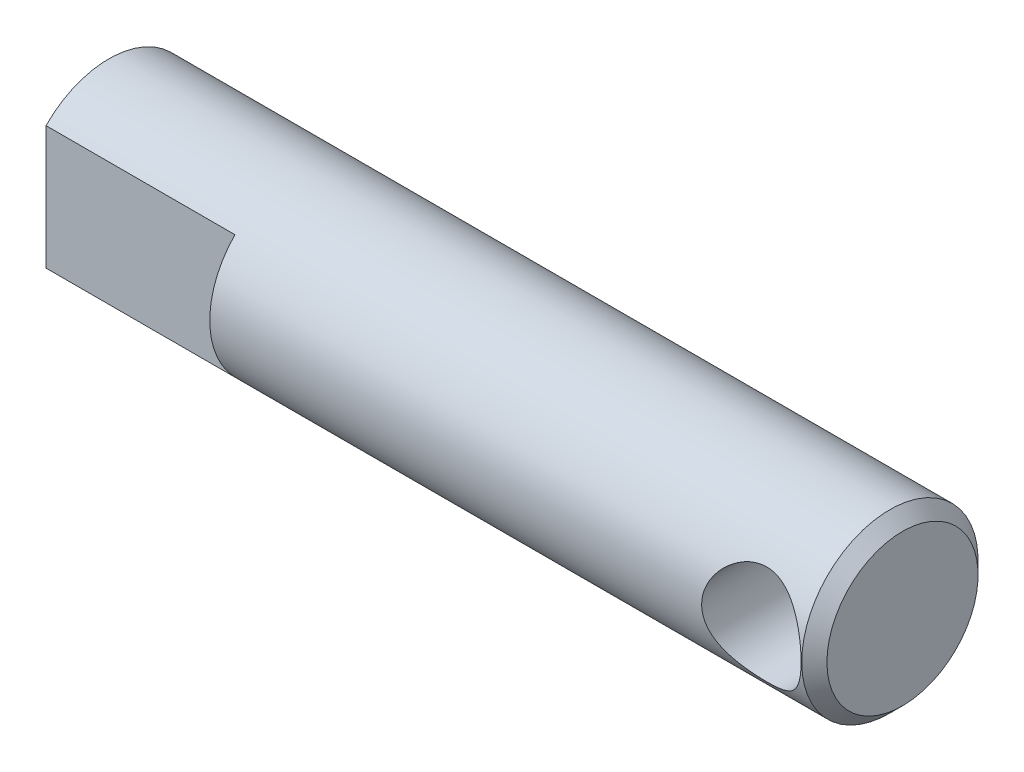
ISO-10303-21;
HEADER;
FILE_DESCRIPTION(('STEP AP214'),'2;1');
FILE_NAME('part.step','',(''),(''),'','','');
FILE_SCHEMA(('AUTOMOTIVE_DESIGN { 1 0 10303 214 1 1 1 1 }'));
ENDSEC;
DATA;
#1=APPLICATION_CONTEXT('core data for automotive mechanical design processes');
#2=APPLICATION_PROTOCOL_DEFINITION('international standard','automotive_design',2000,#1);
#3=PRODUCT_CONTEXT('',#1,'mechanical');
#4=PRODUCT('Part','Part','',(#3));
#5=PRODUCT_RELATED_PRODUCT_CATEGORY('part','',(#4));
#6=PRODUCT_DEFINITION_FORMATION('','',#4);
#7=PRODUCT_DEFINITION_CONTEXT('part definition',#1,'design');
#8=PRODUCT_DEFINITION('design','',#6,#7);
#9=PRODUCT_DEFINITION_SHAPE('','',#8);
#10=(LENGTH_UNIT() NAMED_UNIT(*) SI_UNIT(.MILLI.,.METRE.));
#11=(NAMED_UNIT(*) PLANE_ANGLE_UNIT() SI_UNIT($,.RADIAN.));
#12=(NAMED_UNIT(*) SI_UNIT($,.STERADIAN.) SOLID_ANGLE_UNIT());
#13=UNCERTAINTY_MEASURE_WITH_UNIT(LENGTH_MEASURE(1.E-05),#10,'distance_accuracy_value','');
#14=(GEOMETRIC_REPRESENTATION_CONTEXT(3) GLOBAL_UNCERTAINTY_ASSIGNED_CONTEXT((#13)) GLOBAL_UNIT_ASSIGNED_CONTEXT((#10,
#11,#12)) REPRESENTATION_CONTEXT('',''));
#15=CARTESIAN_POINT('',(0.,0.,0.));
#16=DIRECTION('',(0.,0.,1.));
#17=DIRECTION('',(1.,0.,0.));
#18=AXIS2_PLACEMENT_3D('',#15,#16,#17);
#19=CARTESIAN_POINT('',(-58.,7.,0.));
#20=DIRECTION('',(-1.,0.,0.));
#21=DIRECTION('',(0.,0.,1.));
#22=AXIS2_PLACEMENT_3D('',#19,#20,#21);
#23=PLANE('',#22);
#24=DIRECTION('',(0.,-1.,0.));
#25=VECTOR('',#24,1.);
#26=CARTESIAN_POINT('',(-58.,7.,5.));
#27=LINE('',#26,#25);
#28=CARTESIAN_POINT('',(-58.,4.89897948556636,5.));
#29=VERTEX_POINT('',#28);
#30=CARTESIAN_POINT('',(-58.,-4.89897948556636,5.));
#31=VERTEX_POINT('',#30);
#32=EDGE_CURVE('E55',#29,#31,#27,.T.);
#33=ORIENTED_EDGE('',*,*,#32,.F.);
#34=CARTESIAN_POINT('',(-58.,0.,0.));
#35=DIRECTION('',(1.,0.,0.));
#36=DIRECTION('',(0.,0.,-1.));
#37=AXIS2_PLACEMENT_3D('',#34,#35,#36);
#38=CIRCLE('',#37,7.);
#39=EDGE_CURVE('E61',#31,#29,#38,.T.);
#40=ORIENTED_EDGE('',*,*,#39,.F.);
#41=EDGE_LOOP('',(#33,#40));
#42=FACE_BOUND('',#41,.T.);
#43=ADVANCED_FACE('F29',(#42),#23,.T.);
#44=CARTESIAN_POINT('',(9.,0.,0.));
#45=DIRECTION('',(1.,0.,0.));
#46=DIRECTION('',(0.,0.,-1.));
#47=AXIS2_PLACEMENT_3D('',#44,#45,#46);
#48=CYLINDRICAL_SURFACE('',#47,7.);
#49=ORIENTED_EDGE('',*,*,#39,.T.);
#50=DIRECTION('',(1.,0.,0.));
#51=VECTOR('',#50,1.);
#52=CARTESIAN_POINT('',(9.,4.89897948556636,5.));
#53=LINE('',#52,#51);
#54=CARTESIAN_POINT('',(-43.,4.89897948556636,5.));
#55=VERTEX_POINT('',#54);
#56=EDGE_CURVE('E11',#29,#55,#53,.T.);
#57=ORIENTED_EDGE('',*,*,#56,.T.);
#58=CARTESIAN_POINT('',(-43.,0.,0.));
#59=DIRECTION('',(1.,0.,0.));
#60=DIRECTION('',(0.,0.,-1.));
#61=AXIS2_PLACEMENT_3D('',#58,#59,#60);
#62=CIRCLE('',#61,7.);
#63=CARTESIAN_POINT('',(-43.,-4.89897948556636,5.));
#64=VERTEX_POINT('',#63);
#65=EDGE_CURVE('E46',#55,#64,#62,.T.);
#66=ORIENTED_EDGE('',*,*,#65,.T.);
#67=DIRECTION('',(1.,0.,0.));
#68=VECTOR('',#67,1.);
#69=CARTESIAN_POINT('',(9.,-4.89897948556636,5.));
#70=LINE('',#69,#68);
#71=EDGE_CURVE('E36',#64,#31,#70,.F.);
#72=ORIENTED_EDGE('',*,*,#71,.T.);
#73=EDGE_LOOP('',(#49,#57,#66,#72));
#74=FACE_BOUND('',#73,.T.);
#75=CARTESIAN_POINT('',(-3.95,0.,-7.));
#76=CARTESIAN_POINT('',(-3.95000058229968,-0.102251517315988,-7.00000052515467));
#77=CARTESIAN_POINT('',(-3.94602532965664,-0.204495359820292,-6.9977548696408));
#78=CARTESIAN_POINT('',(-3.93017892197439,-0.408208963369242,-6.98883132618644));
#79=CARTESIAN_POINT('',(-3.91830515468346,-0.509678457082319,-6.9821519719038));
#80=CARTESIAN_POINT('',(-3.88681829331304,-0.71099675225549,-6.96453050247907));
#81=CARTESIAN_POINT('',(-3.86720800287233,-0.810846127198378,-6.95358993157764));
#82=CARTESIAN_POINT('',(-3.82049887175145,-1.00826437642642,-6.9277225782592));
#83=CARTESIAN_POINT('',(-3.79339695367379,-1.10583229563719,-6.91279415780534));
#84=CARTESIAN_POINT('',(-3.70154393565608,-1.39332234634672,-6.86267096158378));
#85=CARTESIAN_POINT('',(-3.62608925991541,-1.57900775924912,-6.82204762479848));
#86=CARTESIAN_POINT('',(-3.4495398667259,-1.93460470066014,-6.72987207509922));
#87=CARTESIAN_POINT('',(-3.34843878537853,-2.10451229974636,-6.67831715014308));
#88=CARTESIAN_POINT('',(-3.11541319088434,-2.4373825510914,-6.56446698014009));
#89=CARTESIAN_POINT('',(-2.98181142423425,-2.59899854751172,-6.50166938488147));
#90=CARTESIAN_POINT('',(-2.69128288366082,-2.89881930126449,-6.37365581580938));
#91=CARTESIAN_POINT('',(-2.53433164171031,-3.03699917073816,-6.30843735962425));
#92=CARTESIAN_POINT('',(-2.18195788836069,-3.30075276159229,-6.17487604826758));
#93=CARTESIAN_POINT('',(-1.98422426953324,-3.4234640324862,-6.10692807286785));
#94=CARTESIAN_POINT('',(-1.56699100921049,-3.63336744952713,-5.98443781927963));
#95=CARTESIAN_POINT('',(-1.34752403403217,-3.72061192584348,-5.92987583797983));
#96=CARTESIAN_POINT('',(-0.941685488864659,-3.8406144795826,-5.8526598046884));
#97=CARTESIAN_POINT('',(-0.758419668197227,-3.88107518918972,-5.82565727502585));
#98=CARTESIAN_POINT('',(-0.386365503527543,-3.93553961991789,-5.7890115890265));
#99=CARTESIAN_POINT('',(-0.197583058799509,-3.94957062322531,-5.77935053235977));
#100=CARTESIAN_POINT('',(0.180299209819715,-3.95041047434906,-5.77877642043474));
#101=CARTESIAN_POINT('',(0.369399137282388,-3.93718559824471,-5.78788659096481));
#102=CARTESIAN_POINT('',(0.742189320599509,-3.88421908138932,-5.82355728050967));
#103=CARTESIAN_POINT('',(0.925875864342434,-3.84445966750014,-5.85012949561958));
#104=CARTESIAN_POINT('',(1.28298214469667,-3.74045603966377,-5.9171579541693));
#105=CARTESIAN_POINT('',(1.45642117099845,-3.67625963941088,-5.95758706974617));
#106=CARTESIAN_POINT('',(1.79062015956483,-3.52559585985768,-6.04796487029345));
#107=CARTESIAN_POINT('',(1.95137518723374,-3.43911986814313,-6.09791723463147));
#108=CARTESIAN_POINT('',(2.28236010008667,-3.23068430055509,-6.21118494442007));
#109=CARTESIAN_POINT('',(2.45013429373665,-3.10528927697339,-6.27536808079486));
#110=CARTESIAN_POINT('',(2.76380860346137,-2.82975913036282,-6.40434802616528));
#111=CARTESIAN_POINT('',(2.90969050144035,-2.67960361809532,-6.46914529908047));
#112=CARTESIAN_POINT('',(3.19135719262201,-2.33913134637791,-6.60038474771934));
#113=CARTESIAN_POINT('',(3.3243448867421,-2.14622765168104,-6.66624727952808));
#114=CARTESIAN_POINT('',(3.49755856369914,-1.8394110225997,-6.75484935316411));
#115=CARTESIAN_POINT('',(3.5509340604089,-1.73418447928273,-6.78269356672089));
#116=CARTESIAN_POINT('',(3.64835561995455,-1.51854178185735,-6.83419932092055));
#117=CARTESIAN_POINT('',(3.6924073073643,-1.40812880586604,-6.8578633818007));
#118=CARTESIAN_POINT('',(3.76787358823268,-1.1907703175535,-6.89879992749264));
#119=CARTESIAN_POINT('',(3.79995387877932,-1.08411750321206,-6.91640241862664));
#120=CARTESIAN_POINT('',(3.85508846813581,-0.867888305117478,-6.94684659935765));
#121=CARTESIAN_POINT('',(3.87814758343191,-0.758313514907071,-6.95969082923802));
#122=CARTESIAN_POINT('',(3.91490558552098,-0.537187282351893,-6.98024022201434));
#123=CARTESIAN_POINT('',(3.92860947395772,-0.425636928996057,-6.98794813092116));
#124=CARTESIAN_POINT('',(3.94645574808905,-0.201537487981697,-6.99799667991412));
#125=CARTESIAN_POINT('',(3.95059914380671,-0.0889885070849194,-7.00033788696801));
#126=CARTESIAN_POINT('',(3.94933984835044,0.122739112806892,-6.999627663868));
#127=CARTESIAN_POINT('',(3.94500600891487,0.221928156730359,-6.9971800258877));
#128=CARTESIAN_POINT('',(3.92890769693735,0.419541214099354,-6.98811643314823));
#129=CARTESIAN_POINT('',(3.9171408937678,0.517964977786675,-6.98149917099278));
#130=CARTESIAN_POINT('',(3.88632356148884,0.713271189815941,-6.96425493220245));
#131=CARTESIAN_POINT('',(3.86727582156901,0.810154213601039,-6.95362949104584));
#132=CARTESIAN_POINT('',(3.82212560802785,1.00178001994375,-6.92862156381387));
#133=CARTESIAN_POINT('',(3.79602041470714,1.09652196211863,-6.91423762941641));
#134=CARTESIAN_POINT('',(3.70796490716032,1.37520140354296,-6.86615280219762));
#135=CARTESIAN_POINT('',(3.6360120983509,1.55521927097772,-6.82736706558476));
#136=CARTESIAN_POINT('',(3.46798264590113,1.90068274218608,-6.7393842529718));
#137=CARTESIAN_POINT('',(3.37189990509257,2.06612464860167,-6.69018454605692));
#138=CARTESIAN_POINT('',(3.14705514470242,2.396342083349,-6.57958100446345));
#139=CARTESIAN_POINT('',(3.01593700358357,2.55926795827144,-6.51744059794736));
#140=CARTESIAN_POINT('',(2.73029779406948,2.86205898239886,-6.39027857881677));
#141=CARTESIAN_POINT('',(2.57575036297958,3.00189777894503,-6.32525377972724));
#142=CARTESIAN_POINT('',(2.22814868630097,3.26970877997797,-6.19142208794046));
#143=CARTESIAN_POINT('',(2.03274539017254,3.39482368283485,-6.1229517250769));
#144=CARTESIAN_POINT('',(1.61992336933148,3.61003258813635,-5.99859885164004));
#145=CARTESIAN_POINT('',(1.40253539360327,3.70017467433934,-5.94269910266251));
#146=CARTESIAN_POINT('',(0.998820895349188,3.82617779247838,-5.86214396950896));
#147=CARTESIAN_POINT('',(0.815640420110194,3.86948469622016,-5.83338201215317));
#148=CARTESIAN_POINT('',(0.443198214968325,3.92957457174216,-5.79308238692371));
#149=CARTESIAN_POINT('',(0.25394324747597,3.94638606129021,-5.78152620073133));
#150=CARTESIAN_POINT('',(-0.125543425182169,3.95257042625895,-5.77730100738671));
#151=CARTESIAN_POINT('',(-0.315776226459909,3.94189800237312,-5.78466318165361));
#152=CARTESIAN_POINT('',(-0.691265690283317,3.89365345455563,-5.81723896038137));
#153=CARTESIAN_POINT('',(-0.876519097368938,3.85606415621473,-5.84246396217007));
#154=CARTESIAN_POINT('',(-1.23541979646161,3.75640700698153,-5.90701621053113));
#155=CARTESIAN_POINT('',(-1.40916943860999,3.69460331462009,-5.94619087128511));
#156=CARTESIAN_POINT('',(-1.74430775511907,3.54870957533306,-6.03439418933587));
#157=CARTESIAN_POINT('',(-1.90569172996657,3.46461110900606,-6.08342656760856));
#158=CARTESIAN_POINT('',(-2.2377542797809,3.26165195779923,-6.19491384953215));
#159=CARTESIAN_POINT('',(-2.40608544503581,3.1394432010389,-6.25827492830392));
#160=CARTESIAN_POINT('',(-2.72141173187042,2.87044638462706,-6.38613993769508));
#161=CARTESIAN_POINT('',(-2.86838923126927,2.72363823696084,-6.45064476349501));
#162=CARTESIAN_POINT('',(-3.1539902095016,2.38923649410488,-6.582346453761));
#163=CARTESIAN_POINT('',(-3.289706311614,2.19889363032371,-6.64899899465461));
#164=CARTESIAN_POINT('',(-3.46740626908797,1.89562056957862,-6.73927571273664));
#165=CARTESIAN_POINT('',(-3.52234673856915,1.79151722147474,-6.76776192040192));
#166=CARTESIAN_POINT('',(-3.62302778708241,1.57799652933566,-6.82070293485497));
#167=CARTESIAN_POINT('',(-3.66877372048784,1.46858232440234,-6.84516008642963));
#168=CARTESIAN_POINT('',(-3.74887272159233,1.24960503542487,-6.88842927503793));
#169=CARTESIAN_POINT('',(-3.78360192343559,1.14021572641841,-6.9074249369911));
#170=CARTESIAN_POINT('',(-3.8435231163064,0.918172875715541,-6.94042819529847));
#171=CARTESIAN_POINT('',(-3.86872028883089,0.805521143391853,-6.95443850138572));
#172=CARTESIAN_POINT('',(-3.90919292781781,0.577976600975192,-6.97703428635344));
#173=CARTESIAN_POINT('',(-3.92447410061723,0.463085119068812,-6.98562288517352));
#174=CARTESIAN_POINT('',(-3.94487669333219,0.232125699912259,-6.99710510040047));
#175=CARTESIAN_POINT('',(-3.94999933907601,0.116057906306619,-6.99999940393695));
#176=CARTESIAN_POINT('',(-3.95,0.,-7.));
#177=B_SPLINE_CURVE_WITH_KNOTS('',3,(#75,#76,#77,#78,#79,#80,#81,#82,#83,#84,#85,#86,#87,#88,
#89,#90,#91,#92,#93,#94,#95,#96,#97,#98,#99,#100,#101,#102,#103,#104,#105,#106,#107,#108,#109,
#110,#111,#112,#113,#114,#115,#116,#117,#118,#119,#120,#121,#122,#123,#124,#125,#126,#127,#128,
#129,#130,#131,#132,#133,#134,#135,#136,#137,#138,#139,#140,#141,#142,#143,#144,#145,#146,#147,
#148,#149,#150,#151,#152,#153,#154,#155,#156,#157,#158,#159,#160,#161,#162,#163,#164,#165,#166,
#167,#168,#169,#170,#171,#172,#173,#174,#175,#176),.UNSPECIFIED.,.T.,.F.,(4,2,2,2,2,2,2,2,2,2,2,
2,2,2,2,2,2,2,2,2,2,2,2,2,2,2,2,2,2,2,2,2,2,2,2,2,2,2,2,2,2,2,2,2,2,2,2,2,2,2,4),(0.,
0.306639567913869,0.613380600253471,0.920010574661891,1.22676669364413,1.83733627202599,
2.44805750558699,3.10208213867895,3.75679701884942,4.48049845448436,5.20312818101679,
5.76949550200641,6.33527786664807,6.90176069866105,7.46862334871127,8.03438252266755,
8.60036072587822,9.25493189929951,9.91004480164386,10.6359893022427,10.9992431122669,
11.3622771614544,11.7000692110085,12.0376806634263,12.3751114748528,12.7125066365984,
13.0100849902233,13.3077566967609,13.6053144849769,13.9029871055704,14.4934275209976,
15.0840172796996,15.7358754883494,16.3884726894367,17.1106877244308,17.8319062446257,
18.400690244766,18.9688616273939,19.5379700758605,20.1074419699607,20.6708670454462,
21.2345051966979,21.8842624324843,22.5345528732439,23.2596712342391,23.6225679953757,
23.985252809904,24.3337283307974,24.6820141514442,25.0300993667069,25.3781425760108),.UNSPECIFIED.);
#178=CARTESIAN_POINT('',(-3.95,0.,-7.));
#179=VERTEX_POINT('',#178);
#180=EDGE_CURVE('E66',#179,#179,#177,.T.);
#181=ORIENTED_EDGE('',*,*,#180,.T.);
#182=EDGE_LOOP('',(#181));
#183=FACE_BOUND('',#182,.T.);
#184=CARTESIAN_POINT('',(3.95,0.,7.));
#185=CARTESIAN_POINT('',(3.95000058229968,-0.102251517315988,7.00000052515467));
#186=CARTESIAN_POINT('',(3.94602532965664,-0.204495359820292,6.9977548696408));
#187=CARTESIAN_POINT('',(3.93017892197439,-0.408208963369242,6.98883132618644));
#188=CARTESIAN_POINT('',(3.91830515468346,-0.509678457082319,6.9821519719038));
#189=CARTESIAN_POINT('',(3.88681829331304,-0.71099675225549,6.96453050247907));
#190=CARTESIAN_POINT('',(3.86720800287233,-0.810846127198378,6.95358993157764));
#191=CARTESIAN_POINT('',(3.82049887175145,-1.00826437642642,6.9277225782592));
#192=CARTESIAN_POINT('',(3.79339695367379,-1.10583229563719,6.91279415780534));
#193=CARTESIAN_POINT('',(3.70154393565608,-1.39332234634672,6.86267096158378));
#194=CARTESIAN_POINT('',(3.62608925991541,-1.57900775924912,6.82204762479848));
#195=CARTESIAN_POINT('',(3.4495398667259,-1.93460470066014,6.72987207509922));
#196=CARTESIAN_POINT('',(3.34843878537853,-2.10451229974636,6.67831715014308));
#197=CARTESIAN_POINT('',(3.11541319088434,-2.4373825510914,6.56446698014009));
#198=CARTESIAN_POINT('',(2.98181142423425,-2.59899854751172,6.50166938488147));
#199=CARTESIAN_POINT('',(2.69128288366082,-2.89881930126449,6.37365581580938));
#200=CARTESIAN_POINT('',(2.53433164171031,-3.03699917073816,6.30843735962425));
#201=CARTESIAN_POINT('',(2.18195788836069,-3.30075276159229,6.17487604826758));
#202=CARTESIAN_POINT('',(1.98422426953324,-3.4234640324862,6.10692807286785));
#203=CARTESIAN_POINT('',(1.56699100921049,-3.63336744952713,5.98443781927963));
#204=CARTESIAN_POINT('',(1.34752403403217,-3.72061192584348,5.92987583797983));
#205=CARTESIAN_POINT('',(0.941685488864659,-3.8406144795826,5.8526598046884));
#206=CARTESIAN_POINT('',(0.758419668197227,-3.88107518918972,5.82565727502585));
#207=CARTESIAN_POINT('',(0.386365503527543,-3.93553961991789,5.7890115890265));
#208=CARTESIAN_POINT('',(0.197583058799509,-3.94957062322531,5.77935053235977));
#209=CARTESIAN_POINT('',(-0.180299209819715,-3.95041047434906,5.77877642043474));
#210=CARTESIAN_POINT('',(-0.369399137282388,-3.93718559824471,5.78788659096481));
#211=CARTESIAN_POINT('',(-0.742189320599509,-3.88421908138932,5.82355728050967));
#212=CARTESIAN_POINT('',(-0.925875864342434,-3.84445966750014,5.85012949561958));
#213=CARTESIAN_POINT('',(-1.28298214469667,-3.74045603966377,5.9171579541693));
#214=CARTESIAN_POINT('',(-1.45642117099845,-3.67625963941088,5.95758706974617));
#215=CARTESIAN_POINT('',(-1.79062015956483,-3.52559585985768,6.04796487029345));
#216=CARTESIAN_POINT('',(-1.95137518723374,-3.43911986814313,6.09791723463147));
#217=CARTESIAN_POINT('',(-2.28236010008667,-3.23068430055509,6.21118494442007));
#218=CARTESIAN_POINT('',(-2.45013429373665,-3.10528927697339,6.27536808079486));
#219=CARTESIAN_POINT('',(-2.76380860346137,-2.82975913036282,6.40434802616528));
#220=CARTESIAN_POINT('',(-2.90969050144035,-2.67960361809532,6.46914529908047));
#221=CARTESIAN_POINT('',(-3.19135719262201,-2.33913134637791,6.60038474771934));
#222=CARTESIAN_POINT('',(-3.3243448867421,-2.14622765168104,6.66624727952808));
#223=CARTESIAN_POINT('',(-3.49755856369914,-1.8394110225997,6.75484935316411));
#224=CARTESIAN_POINT('',(-3.5509340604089,-1.73418447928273,6.78269356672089));
#225=CARTESIAN_POINT('',(-3.64835561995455,-1.51854178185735,6.83419932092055));
#226=CARTESIAN_POINT('',(-3.6924073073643,-1.40812880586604,6.8578633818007));
#227=CARTESIAN_POINT('',(-3.76787358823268,-1.1907703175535,6.89879992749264));
#228=CARTESIAN_POINT('',(-3.79995387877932,-1.08411750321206,6.91640241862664));
#229=CARTESIAN_POINT('',(-3.85508846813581,-0.867888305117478,6.94684659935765));
#230=CARTESIAN_POINT('',(-3.87814758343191,-0.758313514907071,6.95969082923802));
#231=CARTESIAN_POINT('',(-3.91490558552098,-0.537187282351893,6.98024022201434));
#232=CARTESIAN_POINT('',(-3.92860947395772,-0.425636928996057,6.98794813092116));
#233=CARTESIAN_POINT('',(-3.94645574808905,-0.201537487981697,6.99799667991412));
#234=CARTESIAN_POINT('',(-3.95059914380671,-0.0889885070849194,7.00033788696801));
#235=CARTESIAN_POINT('',(-3.94933984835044,0.122739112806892,6.999627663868));
#236=CARTESIAN_POINT('',(-3.94500600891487,0.221928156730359,6.9971800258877));
#237=CARTESIAN_POINT('',(-3.92890769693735,0.419541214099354,6.98811643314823));
#238=CARTESIAN_POINT('',(-3.9171408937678,0.517964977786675,6.98149917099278));
#239=CARTESIAN_POINT('',(-3.88632356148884,0.713271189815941,6.96425493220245));
#240=CARTESIAN_POINT('',(-3.86727582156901,0.810154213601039,6.95362949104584));
#241=CARTESIAN_POINT('',(-3.82212560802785,1.00178001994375,6.92862156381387));
#242=CARTESIAN_POINT('',(-3.79602041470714,1.09652196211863,6.91423762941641));
#243=CARTESIAN_POINT('',(-3.70796490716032,1.37520140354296,6.86615280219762));
#244=CARTESIAN_POINT('',(-3.6360120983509,1.55521927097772,6.82736706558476));
#245=CARTESIAN_POINT('',(-3.46798264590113,1.90068274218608,6.7393842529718));
#246=CARTESIAN_POINT('',(-3.37189990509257,2.06612464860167,6.69018454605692));
#247=CARTESIAN_POINT('',(-3.14705514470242,2.396342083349,6.57958100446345));
#248=CARTESIAN_POINT('',(-3.01593700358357,2.55926795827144,6.51744059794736));
#249=CARTESIAN_POINT('',(-2.73029779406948,2.86205898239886,6.39027857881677));
#250=CARTESIAN_POINT('',(-2.57575036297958,3.00189777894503,6.32525377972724));
#251=CARTESIAN_POINT('',(-2.22814868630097,3.26970877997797,6.19142208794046));
#252=CARTESIAN_POINT('',(-2.03274539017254,3.39482368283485,6.1229517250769));
#253=CARTESIAN_POINT('',(-1.61992336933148,3.61003258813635,5.99859885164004));
#254=CARTESIAN_POINT('',(-1.40253539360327,3.70017467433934,5.94269910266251));
#255=CARTESIAN_POINT('',(-0.998820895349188,3.82617779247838,5.86214396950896));
#256=CARTESIAN_POINT('',(-0.815640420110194,3.86948469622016,5.83338201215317));
#257=CARTESIAN_POINT('',(-0.443198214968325,3.92957457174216,5.79308238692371));
#258=CARTESIAN_POINT('',(-0.25394324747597,3.94638606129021,5.78152620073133));
#259=CARTESIAN_POINT('',(0.125543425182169,3.95257042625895,5.77730100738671));
#260=CARTESIAN_POINT('',(0.315776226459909,3.94189800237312,5.78466318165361));
#261=CARTESIAN_POINT('',(0.691265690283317,3.89365345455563,5.81723896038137));
#262=CARTESIAN_POINT('',(0.876519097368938,3.85606415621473,5.84246396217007));
#263=CARTESIAN_POINT('',(1.23541979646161,3.75640700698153,5.90701621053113));
#264=CARTESIAN_POINT('',(1.40916943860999,3.69460331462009,5.94619087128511));
#265=CARTESIAN_POINT('',(1.74430775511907,3.54870957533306,6.03439418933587));
#266=CARTESIAN_POINT('',(1.90569172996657,3.46461110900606,6.08342656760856));
#267=CARTESIAN_POINT('',(2.2377542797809,3.26165195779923,6.19491384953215));
#268=CARTESIAN_POINT('',(2.40608544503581,3.1394432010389,6.25827492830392));
#269=CARTESIAN_POINT('',(2.72141173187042,2.87044638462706,6.38613993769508));
#270=CARTESIAN_POINT('',(2.86838923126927,2.72363823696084,6.45064476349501));
#271=CARTESIAN_POINT('',(3.1539902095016,2.38923649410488,6.582346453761));
#272=CARTESIAN_POINT('',(3.289706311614,2.19889363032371,6.64899899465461));
#273=CARTESIAN_POINT('',(3.46740626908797,1.89562056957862,6.73927571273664));
#274=CARTESIAN_POINT('',(3.52234673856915,1.79151722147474,6.76776192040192));
#275=CARTESIAN_POINT('',(3.62302778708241,1.57799652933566,6.82070293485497));
#276=CARTESIAN_POINT('',(3.66877372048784,1.46858232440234,6.84516008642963));
#277=CARTESIAN_POINT('',(3.74887272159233,1.24960503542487,6.88842927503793));
#278=CARTESIAN_POINT('',(3.78360192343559,1.14021572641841,6.9074249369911));
#279=CARTESIAN_POINT('',(3.8435231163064,0.918172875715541,6.94042819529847));
#280=CARTESIAN_POINT('',(3.86872028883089,0.805521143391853,6.95443850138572));
#281=CARTESIAN_POINT('',(3.90919292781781,0.577976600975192,6.97703428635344));
#282=CARTESIAN_POINT('',(3.92447410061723,0.463085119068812,6.98562288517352));
#283=CARTESIAN_POINT('',(3.94487669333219,0.232125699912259,6.99710510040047));
#284=CARTESIAN_POINT('',(3.94999933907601,0.116057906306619,6.99999940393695));
#285=CARTESIAN_POINT('',(3.95,0.,7.));
#286=B_SPLINE_CURVE_WITH_KNOTS('',3,(#184,#185,#186,#187,#188,#189,#190,#191,#192,#193,#194,
#195,#196,#197,#198,#199,#200,#201,#202,#203,#204,#205,#206,#207,#208,#209,#210,#211,#212,#213,
#214,#215,#216,#217,#218,#219,#220,#221,#222,#223,#224,#225,#226,#227,#228,#229,#230,#231,#232,
#233,#234,#235,#236,#237,#238,#239,#240,#241,#242,#243,#244,#245,#246,#247,#248,#249,#250,#251,
#252,#253,#254,#255,#256,#257,#258,#259,#260,#261,#262,#263,#264,#265,#266,#267,#268,#269,#270,
#271,#272,#273,#274,#275,#276,#277,#278,#279,#280,#281,#282,#283,#284,#285),.UNSPECIFIED.,.T.,
.F.,(4,2,2,2,2,2,2,2,2,2,2,2,2,2,2,2,2,2,2,2,2,2,2,2,2,2,2,2,2,2,2,2,2,2,2,2,2,2,2,2,2,2,2,2,2,
2,2,2,2,2,4),(0.,0.306639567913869,0.613380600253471,0.920010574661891,1.22676669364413,
1.83733627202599,2.44805750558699,3.10208213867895,3.75679701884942,4.48049845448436,
5.20312818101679,5.76949550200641,6.33527786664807,6.90176069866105,7.46862334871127,
8.03438252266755,8.60036072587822,9.25493189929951,9.91004480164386,10.6359893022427,
10.9992431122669,11.3622771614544,11.7000692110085,12.0376806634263,12.3751114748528,
12.7125066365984,13.0100849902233,13.3077566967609,13.6053144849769,13.9029871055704,
14.4934275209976,15.0840172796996,15.7358754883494,16.3884726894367,17.1106877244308,
17.8319062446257,18.400690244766,18.9688616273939,19.5379700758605,20.1074419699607,
20.6708670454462,21.2345051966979,21.8842624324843,22.5345528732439,23.2596712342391,
23.6225679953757,23.985252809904,24.3337283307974,24.6820141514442,25.0300993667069,
25.3781425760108),.UNSPECIFIED.);
#287=CARTESIAN_POINT('',(3.95,0.,7.));
#288=VERTEX_POINT('',#287);
#289=EDGE_CURVE('E72',#288,#288,#286,.T.);
#290=ORIENTED_EDGE('',*,*,#289,.T.);
#291=EDGE_LOOP('',(#290));
#292=FACE_BOUND('',#291,.T.);
#293=CARTESIAN_POINT('',(3.99999999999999,0.,0.));
#294=DIRECTION('',(-1.,0.,0.));
#295=DIRECTION('',(0.,0.,1.));
#296=AXIS2_PLACEMENT_3D('',#293,#294,#295);
#297=CIRCLE('',#296,7.);
#298=CARTESIAN_POINT('',(3.99999999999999,0.,7.));
#299=VERTEX_POINT('',#298);
#300=EDGE_CURVE('E69',#299,#299,#297,.T.);
#301=ORIENTED_EDGE('',*,*,#300,.T.);
#302=EDGE_LOOP('',(#301));
#303=FACE_BOUND('',#302,.T.);
#304=ADVANCED_FACE('F63',(#74,#183,#292,#303),#48,.T.);
#305=CARTESIAN_POINT('',(5.,7.,0.));
#306=DIRECTION('',(-1.,0.,0.));
#307=DIRECTION('',(0.,0.,1.));
#308=AXIS2_PLACEMENT_3D('',#305,#306,#307);
#309=PLANE('',#308);
#310=CARTESIAN_POINT('',(5.,0.,0.));
#311=DIRECTION('',(-1.,0.,0.));
#312=DIRECTION('',(0.,0.,1.));
#313=AXIS2_PLACEMENT_3D('',#310,#311,#312);
#314=CIRCLE('',#313,5.99999999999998);
#315=CARTESIAN_POINT('',(5.,0.,5.99999999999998));
#316=VERTEX_POINT('',#315);
#317=EDGE_CURVE('E65',#316,#316,#314,.F.);
#318=ORIENTED_EDGE('',*,*,#317,.T.);
#319=EDGE_LOOP('',(#318));
#320=FACE_BOUND('',#319,.T.);
#321=ADVANCED_FACE('F97',(#320),#309,.F.);
#322=CARTESIAN_POINT('',(5.,0.,0.));
#323=DIRECTION('',(-1.,0.,0.));
#324=DIRECTION('',(0.,0.,1.));
#325=AXIS2_PLACEMENT_3D('',#322,#323,#324);
#326=CONICAL_SURFACE('',#325,5.99999999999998,0.785398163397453);
#327=ORIENTED_EDGE('',*,*,#300,.F.);
#328=EDGE_LOOP('',(#327));
#329=FACE_BOUND('',#328,.T.);
#330=ORIENTED_EDGE('',*,*,#317,.F.);
#331=EDGE_LOOP('',(#330));
#332=FACE_BOUND('',#331,.T.);
#333=ADVANCED_FACE('F92',(#329,#332),#326,.T.);
#334=CARTESIAN_POINT('',(0.,0.,-10.));
#335=DIRECTION('',(0.,0.,1.));
#336=DIRECTION('',(1.,0.,0.));
#337=AXIS2_PLACEMENT_3D('',#334,#335,#336);
#338=CYLINDRICAL_SURFACE('',#337,3.95);
#339=ORIENTED_EDGE('',*,*,#289,.F.);
#340=EDGE_LOOP('',(#339));
#341=FACE_BOUND('',#340,.T.);
#342=ORIENTED_EDGE('',*,*,#180,.F.);
#343=EDGE_LOOP('',(#342));
#344=FACE_BOUND('',#343,.T.);
#345=ADVANCED_FACE('F87',(#341,#344),#338,.F.);
#346=CARTESIAN_POINT('',(-43.,7.,5.));
#347=DIRECTION('',(0.,0.,-1.));
#348=DIRECTION('',(-1.,0.,0.));
#349=AXIS2_PLACEMENT_3D('',#346,#347,#348);
#350=PLANE('',#349);
#351=ORIENTED_EDGE('',*,*,#32,.T.);
#352=ORIENTED_EDGE('',*,*,#71,.F.);
#353=DIRECTION('',(0.,-1.,0.));
#354=VECTOR('',#353,1.);
#355=CARTESIAN_POINT('',(-43.,7.,5.));
#356=LINE('',#355,#354);
#357=EDGE_CURVE('E42',#55,#64,#356,.T.);
#358=ORIENTED_EDGE('',*,*,#357,.F.);
#359=ORIENTED_EDGE('',*,*,#56,.F.);
#360=EDGE_LOOP('',(#351,#352,#358,#359));
#361=FACE_BOUND('',#360,.T.);
#362=ADVANCED_FACE('F54',(#361),#350,.F.);
#363=CARTESIAN_POINT('',(-43.,-6.,5.));
#364=DIRECTION('',(1.,0.,0.));
#365=DIRECTION('',(0.,0.,-1.));
#366=AXIS2_PLACEMENT_3D('',#363,#364,#365);
#367=PLANE('',#366);
#368=ORIENTED_EDGE('',*,*,#357,.T.);
#369=ORIENTED_EDGE('',*,*,#65,.F.);
#370=EDGE_LOOP('',(#368,#369));
#371=FACE_BOUND('',#370,.T.);
#372=ADVANCED_FACE('F136',(#371),#367,.F.);
#373=CLOSED_SHELL('',(#43,#304,#321,#333,#345,#362,#372));
#374=MANIFOLD_SOLID_BREP('B2',#373);
#375=ADVANCED_BREP_SHAPE_REPRESENTATION('',(#18,#374),#14);
#376=SHAPE_DEFINITION_REPRESENTATION(#9,#375);
ENDSEC;
END-ISO-10303-21;
